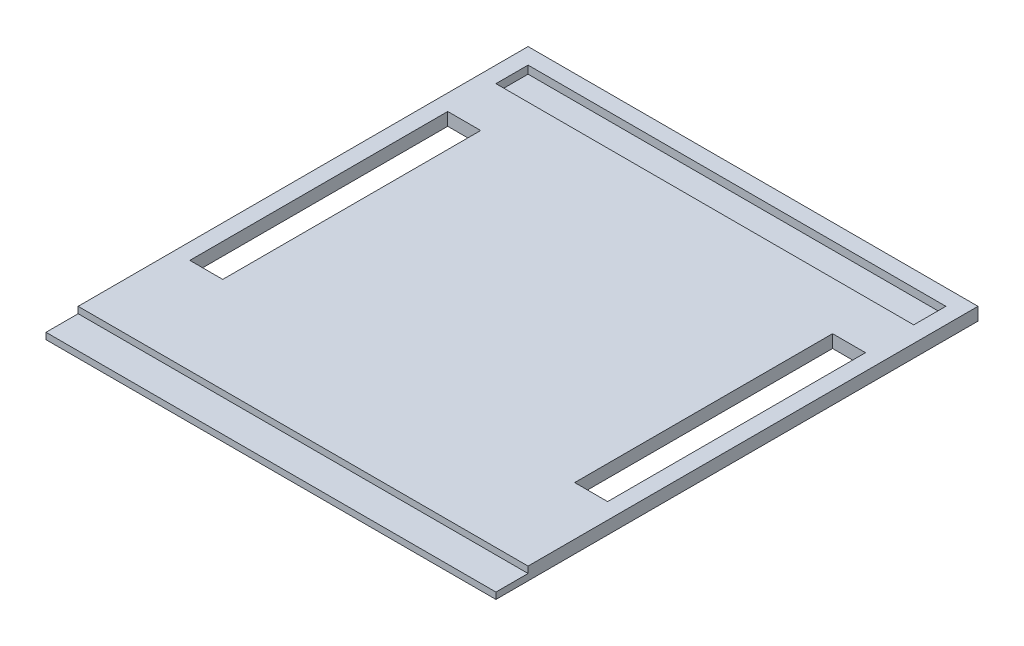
ISO-10303-21;
HEADER;
FILE_DESCRIPTION(('STEP AP214'),'2;1');
FILE_NAME('part.step','',(''),(''),'','','');
FILE_SCHEMA(('AUTOMOTIVE_DESIGN { 1 0 10303 214 1 1 1 1 }'));
ENDSEC;
DATA;
#1=APPLICATION_CONTEXT('core data for automotive mechanical design processes');
#2=APPLICATION_PROTOCOL_DEFINITION('international standard','automotive_design',2000,#1);
#3=PRODUCT_CONTEXT('',#1,'mechanical');
#4=PRODUCT('Part','Part','',(#3));
#5=PRODUCT_RELATED_PRODUCT_CATEGORY('part','',(#4));
#6=PRODUCT_DEFINITION_FORMATION('','',#4);
#7=PRODUCT_DEFINITION_CONTEXT('part definition',#1,'design');
#8=PRODUCT_DEFINITION('design','',#6,#7);
#9=PRODUCT_DEFINITION_SHAPE('','',#8);
#10=(LENGTH_UNIT() NAMED_UNIT(*) SI_UNIT(.MILLI.,.METRE.));
#11=(NAMED_UNIT(*) PLANE_ANGLE_UNIT() SI_UNIT($,.RADIAN.));
#12=(NAMED_UNIT(*) SI_UNIT($,.STERADIAN.) SOLID_ANGLE_UNIT());
#13=UNCERTAINTY_MEASURE_WITH_UNIT(LENGTH_MEASURE(1.E-05),#10,'distance_accuracy_value','');
#14=(GEOMETRIC_REPRESENTATION_CONTEXT(3) GLOBAL_UNCERTAINTY_ASSIGNED_CONTEXT((#13)) GLOBAL_UNIT_ASSIGNED_CONTEXT((#10,
#11,#12)) REPRESENTATION_CONTEXT('',''));
#15=CARTESIAN_POINT('',(0.,0.,0.));
#16=DIRECTION('',(0.,0.,1.));
#17=DIRECTION('',(1.,0.,0.));
#18=AXIS2_PLACEMENT_3D('',#15,#16,#17);
#19=CARTESIAN_POINT('',(0.,29.,-70.));
#20=DIRECTION('',(0.,0.,-1.));
#21=DIRECTION('',(-1.,0.,0.));
#22=AXIS2_PLACEMENT_3D('',#19,#20,#21);
#23=PLANE('',#22);
#24=DIRECTION('',(-1.,0.,0.));
#25=VECTOR('',#24,1.);
#26=CARTESIAN_POINT('',(0.,2.,-70.));
#27=LINE('',#26,#25);
#28=CARTESIAN_POINT('',(70.,2.00000000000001,-70.));
#29=VERTEX_POINT('',#28);
#30=CARTESIAN_POINT('',(-70.,2.,-70.));
#31=VERTEX_POINT('',#30);
#32=EDGE_CURVE('E64',#29,#31,#27,.T.);
#33=ORIENTED_EDGE('',*,*,#32,.F.);
#34=DIRECTION('',(0.,-1.,0.));
#35=VECTOR('',#34,1.);
#36=CARTESIAN_POINT('',(70.,29.,-70.));
#37=LINE('',#36,#35);
#38=CARTESIAN_POINT('',(70.,4.00000000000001,-70.));
#39=VERTEX_POINT('',#38);
#40=EDGE_CURVE('E220',#39,#29,#37,.T.);
#41=ORIENTED_EDGE('',*,*,#40,.F.);
#42=DIRECTION('',(-1.,0.,0.));
#43=VECTOR('',#42,1.);
#44=CARTESIAN_POINT('',(0.,4.,-70.));
#45=LINE('',#44,#43);
#46=CARTESIAN_POINT('',(-70.,4.00000000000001,-70.));
#47=VERTEX_POINT('',#46);
#48=EDGE_CURVE('E235',#39,#47,#45,.T.);
#49=ORIENTED_EDGE('',*,*,#48,.T.);
#50=DIRECTION('',(0.,-1.,0.));
#51=VECTOR('',#50,1.);
#52=CARTESIAN_POINT('',(-70.,29.,-70.));
#53=LINE('',#52,#51);
#54=EDGE_CURVE('E231',#47,#31,#53,.T.);
#55=ORIENTED_EDGE('',*,*,#54,.T.);
#56=EDGE_LOOP('',(#33,#41,#49,#55));
#57=FACE_BOUND('',#56,.T.);
#58=ADVANCED_FACE('F45',(#57),#23,.F.);
#59=CARTESIAN_POINT('',(0.,4.,0.));
#60=DIRECTION('',(0.,1.,0.));
#61=DIRECTION('',(0.,0.,1.));
#62=AXIS2_PLACEMENT_3D('',#59,#60,#61);
#63=PLANE('',#62);
#64=ORIENTED_EDGE('',*,*,#48,.F.);
#65=DIRECTION('',(0.,0.,-1.));
#66=VECTOR('',#65,1.);
#67=CARTESIAN_POINT('',(70.,4.,-210.));
#68=LINE('',#67,#66);
#69=CARTESIAN_POINT('',(70.,4.,-210.));
#70=VERTEX_POINT('',#69);
#71=EDGE_CURVE('E337',#39,#70,#68,.T.);
#72=ORIENTED_EDGE('',*,*,#71,.T.);
#73=DIRECTION('',(-1.,0.,0.));
#74=VECTOR('',#73,1.);
#75=CARTESIAN_POINT('',(-70.,4.,-210.));
#76=LINE('',#75,#74);
#77=CARTESIAN_POINT('',(-70.,4.,-210.));
#78=VERTEX_POINT('',#77);
#79=EDGE_CURVE('E340',#70,#78,#76,.T.);
#80=ORIENTED_EDGE('',*,*,#79,.T.);
#81=DIRECTION('',(0.,0.,1.));
#82=VECTOR('',#81,1.);
#83=CARTESIAN_POINT('',(-70.,4.,-210.));
#84=LINE('',#83,#82);
#85=EDGE_CURVE('E344',#78,#47,#84,.T.);
#86=ORIENTED_EDGE('',*,*,#85,.T.);
#87=EDGE_LOOP('',(#64,#72,#80,#86));
#88=FACE_BOUND('',#87,.T.);
#89=DIRECTION('',(0.,0.,1.));
#90=VECTOR('',#89,1.);
#91=CARTESIAN_POINT('',(-65.,4.,-205.));
#92=LINE('',#91,#90);
#93=CARTESIAN_POINT('',(-65.,4.,-205.));
#94=VERTEX_POINT('',#93);
#95=CARTESIAN_POINT('',(-65.,4.,-195.));
#96=VERTEX_POINT('',#95);
#97=EDGE_CURVE('E75',#94,#96,#92,.T.);
#98=ORIENTED_EDGE('',*,*,#97,.F.);
#99=DIRECTION('',(1.,0.,0.));
#100=VECTOR('',#99,1.);
#101=CARTESIAN_POINT('',(-65.,4.,-205.));
#102=LINE('',#101,#100);
#103=CARTESIAN_POINT('',(65.,4.,-205.));
#104=VERTEX_POINT('',#103);
#105=EDGE_CURVE('E245',#94,#104,#102,.T.);
#106=ORIENTED_EDGE('',*,*,#105,.T.);
#107=DIRECTION('',(0.,0.,1.));
#108=VECTOR('',#107,1.);
#109=CARTESIAN_POINT('',(65.,4.,-205.));
#110=LINE('',#109,#108);
#111=CARTESIAN_POINT('',(65.,4.,-195.));
#112=VERTEX_POINT('',#111);
#113=EDGE_CURVE('E262',#104,#112,#110,.T.);
#114=ORIENTED_EDGE('',*,*,#113,.T.);
#115=DIRECTION('',(1.,0.,0.));
#116=VECTOR('',#115,1.);
#117=CARTESIAN_POINT('',(-65.,4.,-195.));
#118=LINE('',#117,#116);
#119=EDGE_CURVE('E258',#96,#112,#118,.T.);
#120=ORIENTED_EDGE('',*,*,#119,.F.);
#121=EDGE_LOOP('',(#98,#106,#114,#120));
#122=FACE_BOUND('',#121,.T.);
#123=DIRECTION('',(0.,0.,1.));
#124=VECTOR('',#123,1.);
#125=CARTESIAN_POINT('',(-65.,4.,-180.));
#126=LINE('',#125,#124);
#127=CARTESIAN_POINT('',(-65.,4.,-180.));
#128=VERTEX_POINT('',#127);
#129=CARTESIAN_POINT('',(-65.,4.,-99.75));
#130=VERTEX_POINT('',#129);
#131=EDGE_CURVE('E281',#128,#130,#126,.T.);
#132=ORIENTED_EDGE('',*,*,#131,.F.);
#133=DIRECTION('',(-1.,0.,0.));
#134=VECTOR('',#133,1.);
#135=CARTESIAN_POINT('',(-65.,4.,-180.));
#136=LINE('',#135,#134);
#137=CARTESIAN_POINT('',(-54.75,4.,-180.));
#138=VERTEX_POINT('',#137);
#139=EDGE_CURVE('E293',#138,#128,#136,.T.);
#140=ORIENTED_EDGE('',*,*,#139,.F.);
#141=DIRECTION('',(0.,0.,-1.));
#142=VECTOR('',#141,1.);
#143=CARTESIAN_POINT('',(-54.75,4.,-180.));
#144=LINE('',#143,#142);
#145=CARTESIAN_POINT('',(-54.75,4.,-99.75));
#146=VERTEX_POINT('',#145);
#147=EDGE_CURVE('E289',#146,#138,#144,.T.);
#148=ORIENTED_EDGE('',*,*,#147,.F.);
#149=DIRECTION('',(1.,0.,0.));
#150=VECTOR('',#149,1.);
#151=CARTESIAN_POINT('',(-65.,4.,-99.75));
#152=LINE('',#151,#150);
#153=EDGE_CURVE('E284',#130,#146,#152,.T.);
#154=ORIENTED_EDGE('',*,*,#153,.F.);
#155=EDGE_LOOP('',(#132,#140,#148,#154));
#156=FACE_BOUND('',#155,.T.);
#157=DIRECTION('',(0.,0.,1.));
#158=VECTOR('',#157,1.);
#159=CARTESIAN_POINT('',(54.75,4.,-180.));
#160=LINE('',#159,#158);
#161=CARTESIAN_POINT('',(54.75,4.,-180.));
#162=VERTEX_POINT('',#161);
#163=CARTESIAN_POINT('',(54.75,4.,-99.75));
#164=VERTEX_POINT('',#163);
#165=EDGE_CURVE('E272',#162,#164,#160,.T.);
#166=ORIENTED_EDGE('',*,*,#165,.F.);
#167=DIRECTION('',(-1.,0.,0.));
#168=VECTOR('',#167,1.);
#169=CARTESIAN_POINT('',(54.75,4.,-180.));
#170=LINE('',#169,#168);
#171=CARTESIAN_POINT('',(65.,4.,-180.));
#172=VERTEX_POINT('',#171);
#173=EDGE_CURVE('E321',#172,#162,#170,.T.);
#174=ORIENTED_EDGE('',*,*,#173,.F.);
#175=DIRECTION('',(0.,0.,-1.));
#176=VECTOR('',#175,1.);
#177=CARTESIAN_POINT('',(65.,4.,-180.));
#178=LINE('',#177,#176);
#179=CARTESIAN_POINT('',(65.,4.,-99.75));
#180=VERTEX_POINT('',#179);
#181=EDGE_CURVE('E317',#180,#172,#178,.T.);
#182=ORIENTED_EDGE('',*,*,#181,.F.);
#183=DIRECTION('',(1.,0.,0.));
#184=VECTOR('',#183,1.);
#185=CARTESIAN_POINT('',(54.75,4.,-99.75));
#186=LINE('',#185,#184);
#187=EDGE_CURVE('E313',#164,#180,#186,.T.);
#188=ORIENTED_EDGE('',*,*,#187,.F.);
#189=EDGE_LOOP('',(#166,#174,#182,#188));
#190=FACE_BOUND('',#189,.T.);
#191=ADVANCED_FACE('F403',(#88,#122,#156,#190),#63,.T.);
#192=CARTESIAN_POINT('',(70.,4.,-210.));
#193=DIRECTION('',(-1.,0.,0.));
#194=DIRECTION('',(0.,0.,1.));
#195=AXIS2_PLACEMENT_3D('',#192,#193,#194);
#196=PLANE('',#195);
#197=ORIENTED_EDGE('',*,*,#71,.F.);
#198=ORIENTED_EDGE('',*,*,#40,.T.);
#199=DIRECTION('',(0.,0.,1.));
#200=VECTOR('',#199,1.);
#201=CARTESIAN_POINT('',(70.,2.,0.));
#202=LINE('',#201,#200);
#203=CARTESIAN_POINT('',(70.,2.,-60.));
#204=VERTEX_POINT('',#203);
#205=EDGE_CURVE('E201',#29,#204,#202,.T.);
#206=ORIENTED_EDGE('',*,*,#205,.T.);
#207=DIRECTION('',(0.,-1.,0.));
#208=VECTOR('',#207,1.);
#209=CARTESIAN_POINT('',(70.,2.,-60.));
#210=LINE('',#209,#208);
#211=CARTESIAN_POINT('',(70.,0.,-60.));
#212=VERTEX_POINT('',#211);
#213=EDGE_CURVE('E211',#204,#212,#210,.T.);
#214=ORIENTED_EDGE('',*,*,#213,.T.);
#215=DIRECTION('',(0.,0.,-1.));
#216=VECTOR('',#215,1.);
#217=CARTESIAN_POINT('',(70.,0.,-210.));
#218=LINE('',#217,#216);
#219=CARTESIAN_POINT('',(70.,0.,-210.));
#220=VERTEX_POINT('',#219);
#221=EDGE_CURVE('E301',#212,#220,#218,.T.);
#222=ORIENTED_EDGE('',*,*,#221,.T.);
#223=DIRECTION('',(0.,-1.,0.));
#224=VECTOR('',#223,1.);
#225=CARTESIAN_POINT('',(70.,4.,-210.));
#226=LINE('',#225,#224);
#227=EDGE_CURVE('E359',#70,#220,#226,.T.);
#228=ORIENTED_EDGE('',*,*,#227,.F.);
#229=EDGE_LOOP('',(#197,#198,#206,#214,#222,#228));
#230=FACE_BOUND('',#229,.T.);
#231=ADVANCED_FACE('F47',(#230),#196,.F.);
#232=CARTESIAN_POINT('',(-70.,4.,-210.));
#233=DIRECTION('',(0.,0.,1.));
#234=DIRECTION('',(1.,0.,0.));
#235=AXIS2_PLACEMENT_3D('',#232,#233,#234);
#236=PLANE('',#235);
#237=DIRECTION('',(-1.,0.,0.));
#238=VECTOR('',#237,1.);
#239=CARTESIAN_POINT('',(-70.,0.,-210.));
#240=LINE('',#239,#238);
#241=CARTESIAN_POINT('',(-70.,0.,-210.));
#242=VERTEX_POINT('',#241);
#243=EDGE_CURVE('E351',#220,#242,#240,.T.);
#244=ORIENTED_EDGE('',*,*,#243,.T.);
#245=DIRECTION('',(0.,-1.,0.));
#246=VECTOR('',#245,1.);
#247=CARTESIAN_POINT('',(-70.,4.,-210.));
#248=LINE('',#247,#246);
#249=EDGE_CURVE('E348',#78,#242,#248,.T.);
#250=ORIENTED_EDGE('',*,*,#249,.F.);
#251=ORIENTED_EDGE('',*,*,#79,.F.);
#252=ORIENTED_EDGE('',*,*,#227,.T.);
#253=EDGE_LOOP('',(#244,#250,#251,#252));
#254=FACE_BOUND('',#253,.T.);
#255=ADVANCED_FACE('F473',(#254),#236,.F.);
#256=CARTESIAN_POINT('',(-70.,4.,-210.));
#257=DIRECTION('',(1.,0.,0.));
#258=DIRECTION('',(0.,0.,-1.));
#259=AXIS2_PLACEMENT_3D('',#256,#257,#258);
#260=PLANE('',#259);
#261=DIRECTION('',(0.,0.,1.));
#262=VECTOR('',#261,1.);
#263=CARTESIAN_POINT('',(-70.,0.,-210.));
#264=LINE('',#263,#262);
#265=CARTESIAN_POINT('',(-70.,0.,-60.));
#266=VERTEX_POINT('',#265);
#267=EDGE_CURVE('E341',#242,#266,#264,.T.);
#268=ORIENTED_EDGE('',*,*,#267,.T.);
#269=DIRECTION('',(0.,-1.,0.));
#270=VECTOR('',#269,1.);
#271=CARTESIAN_POINT('',(-70.,2.,-60.));
#272=LINE('',#271,#270);
#273=CARTESIAN_POINT('',(-70.,2.,-60.));
#274=VERTEX_POINT('',#273);
#275=EDGE_CURVE('E217',#274,#266,#272,.T.);
#276=ORIENTED_EDGE('',*,*,#275,.F.);
#277=DIRECTION('',(0.,0.,1.));
#278=VECTOR('',#277,1.);
#279=CARTESIAN_POINT('',(-70.,2.,0.));
#280=LINE('',#279,#278);
#281=EDGE_CURVE('E203',#31,#274,#280,.T.);
#282=ORIENTED_EDGE('',*,*,#281,.F.);
#283=ORIENTED_EDGE('',*,*,#54,.F.);
#284=ORIENTED_EDGE('',*,*,#85,.F.);
#285=ORIENTED_EDGE('',*,*,#249,.T.);
#286=EDGE_LOOP('',(#268,#276,#282,#283,#284,#285));
#287=FACE_BOUND('',#286,.T.);
#288=ADVANCED_FACE('F471',(#287),#260,.F.);
#289=CARTESIAN_POINT('',(0.,0.,0.));
#290=DIRECTION('',(0.,1.,0.));
#291=DIRECTION('',(0.,0.,1.));
#292=AXIS2_PLACEMENT_3D('',#289,#290,#291);
#293=PLANE('',#292);
#294=DIRECTION('',(-1.,0.,0.));
#295=VECTOR('',#294,1.);
#296=CARTESIAN_POINT('',(0.,0.,-180.));
#297=LINE('',#296,#295);
#298=CARTESIAN_POINT('',(-54.75,0.,-180.));
#299=VERTEX_POINT('',#298);
#300=CARTESIAN_POINT('',(-65.,0.,-180.));
#301=VERTEX_POINT('',#300);
#302=EDGE_CURVE('E54',#299,#301,#297,.T.);
#303=ORIENTED_EDGE('',*,*,#302,.T.);
#304=DIRECTION('',(0.,0.,1.));
#305=VECTOR('',#304,1.);
#306=CARTESIAN_POINT('',(-65.,0.,0.));
#307=LINE('',#306,#305);
#308=CARTESIAN_POINT('',(-65.,0.,-99.75));
#309=VERTEX_POINT('',#308);
#310=EDGE_CURVE('E11',#301,#309,#307,.T.);
#311=ORIENTED_EDGE('',*,*,#310,.T.);
#312=DIRECTION('',(1.,0.,0.));
#313=VECTOR('',#312,1.);
#314=CARTESIAN_POINT('',(1.35054569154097E-13,0.,-99.7499999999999));
#315=LINE('',#314,#313);
#316=CARTESIAN_POINT('',(-54.75,0.,-99.75));
#317=VERTEX_POINT('',#316);
#318=EDGE_CURVE('E379',#309,#317,#315,.T.);
#319=ORIENTED_EDGE('',*,*,#318,.T.);
#320=DIRECTION('',(0.,0.,-1.));
#321=VECTOR('',#320,1.);
#322=CARTESIAN_POINT('',(-54.75,0.,0.));
#323=LINE('',#322,#321);
#324=EDGE_CURVE('E383',#317,#299,#323,.T.);
#325=ORIENTED_EDGE('',*,*,#324,.T.);
#326=EDGE_LOOP('',(#303,#311,#319,#325));
#327=FACE_BOUND('',#326,.T.);
#328=DIRECTION('',(-1.,0.,0.));
#329=VECTOR('',#328,1.);
#330=CARTESIAN_POINT('',(0.,0.,-180.));
#331=LINE('',#330,#329);
#332=CARTESIAN_POINT('',(65.,0.,-180.));
#333=VERTEX_POINT('',#332);
#334=CARTESIAN_POINT('',(54.75,0.,-180.));
#335=VERTEX_POINT('',#334);
#336=EDGE_CURVE('E371',#333,#335,#331,.T.);
#337=ORIENTED_EDGE('',*,*,#336,.T.);
#338=DIRECTION('',(0.,0.,1.));
#339=VECTOR('',#338,1.);
#340=CARTESIAN_POINT('',(54.75,0.,0.));
#341=LINE('',#340,#339);
#342=CARTESIAN_POINT('',(54.75,0.,-99.75));
#343=VERTEX_POINT('',#342);
#344=EDGE_CURVE('E375',#335,#343,#341,.T.);
#345=ORIENTED_EDGE('',*,*,#344,.T.);
#346=DIRECTION('',(1.,0.,0.));
#347=VECTOR('',#346,1.);
#348=CARTESIAN_POINT('',(1.35054569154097E-13,0.,-99.7500000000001));
#349=LINE('',#348,#347);
#350=CARTESIAN_POINT('',(65.,0.,-99.75));
#351=VERTEX_POINT('',#350);
#352=EDGE_CURVE('E363',#343,#351,#349,.T.);
#353=ORIENTED_EDGE('',*,*,#352,.T.);
#354=DIRECTION('',(0.,0.,-1.));
#355=VECTOR('',#354,1.);
#356=CARTESIAN_POINT('',(65.,0.,0.));
#357=LINE('',#356,#355);
#358=EDGE_CURVE('E367',#351,#333,#357,.T.);
#359=ORIENTED_EDGE('',*,*,#358,.T.);
#360=EDGE_LOOP('',(#337,#345,#353,#359));
#361=FACE_BOUND('',#360,.T.);
#362=ORIENTED_EDGE('',*,*,#221,.F.);
#363=DIRECTION('',(1.,0.,0.));
#364=VECTOR('',#363,1.);
#365=CARTESIAN_POINT('',(0.,0.,-60.));
#366=LINE('',#365,#364);
#367=EDGE_CURVE('E214',#266,#212,#366,.T.);
#368=ORIENTED_EDGE('',*,*,#367,.F.);
#369=ORIENTED_EDGE('',*,*,#267,.F.);
#370=ORIENTED_EDGE('',*,*,#243,.F.);
#371=EDGE_LOOP('',(#362,#368,#369,#370));
#372=FACE_BOUND('',#371,.T.);
#373=ADVANCED_FACE('F389',(#327,#361,#372),#293,.F.);
#374=CARTESIAN_POINT('',(54.75,-21.4,-180.));
#375=DIRECTION('',(-1.,0.,0.));
#376=DIRECTION('',(0.,0.,1.));
#377=AXIS2_PLACEMENT_3D('',#374,#375,#376);
#378=PLANE('',#377);
#379=DIRECTION('',(0.,1.,0.));
#380=VECTOR('',#379,1.);
#381=CARTESIAN_POINT('',(54.75,-21.4,-180.));
#382=LINE('',#381,#380);
#383=EDGE_CURVE('E285',#335,#162,#382,.T.);
#384=ORIENTED_EDGE('',*,*,#383,.T.);
#385=ORIENTED_EDGE('',*,*,#165,.T.);
#386=DIRECTION('',(0.,1.,0.));
#387=VECTOR('',#386,1.);
#388=CARTESIAN_POINT('',(54.75,-21.4,-99.75));
#389=LINE('',#388,#387);
#390=EDGE_CURVE('E325',#343,#164,#389,.T.);
#391=ORIENTED_EDGE('',*,*,#390,.F.);
#392=ORIENTED_EDGE('',*,*,#344,.F.);
#393=EDGE_LOOP('',(#384,#385,#391,#392));
#394=FACE_BOUND('',#393,.T.);
#395=ADVANCED_FACE('F461',(#394),#378,.F.);
#396=CARTESIAN_POINT('',(54.75,-21.4,-180.));
#397=DIRECTION('',(0.,0.,-1.));
#398=DIRECTION('',(-1.,0.,0.));
#399=AXIS2_PLACEMENT_3D('',#396,#397,#398);
#400=PLANE('',#399);
#401=DIRECTION('',(0.,1.,0.));
#402=VECTOR('',#401,1.);
#403=CARTESIAN_POINT('',(65.,-21.4,-180.));
#404=LINE('',#403,#402);
#405=EDGE_CURVE('E328',#333,#172,#404,.T.);
#406=ORIENTED_EDGE('',*,*,#405,.T.);
#407=ORIENTED_EDGE('',*,*,#173,.T.);
#408=ORIENTED_EDGE('',*,*,#383,.F.);
#409=ORIENTED_EDGE('',*,*,#336,.F.);
#410=EDGE_LOOP('',(#406,#407,#408,#409));
#411=FACE_BOUND('',#410,.T.);
#412=ADVANCED_FACE('F458',(#411),#400,.F.);
#413=CARTESIAN_POINT('',(65.,-21.4,-180.));
#414=DIRECTION('',(1.,0.,0.));
#415=DIRECTION('',(0.,0.,-1.));
#416=AXIS2_PLACEMENT_3D('',#413,#414,#415);
#417=PLANE('',#416);
#418=DIRECTION('',(0.,1.,0.));
#419=VECTOR('',#418,1.);
#420=CARTESIAN_POINT('',(65.,-21.4,-99.75));
#421=LINE('',#420,#419);
#422=EDGE_CURVE('E331',#351,#180,#421,.T.);
#423=ORIENTED_EDGE('',*,*,#422,.T.);
#424=ORIENTED_EDGE('',*,*,#181,.T.);
#425=ORIENTED_EDGE('',*,*,#405,.F.);
#426=ORIENTED_EDGE('',*,*,#358,.F.);
#427=EDGE_LOOP('',(#423,#424,#425,#426));
#428=FACE_BOUND('',#427,.T.);
#429=ADVANCED_FACE('F454',(#428),#417,.F.);
#430=CARTESIAN_POINT('',(54.75,-21.4,-99.75));
#431=DIRECTION('',(0.,0.,1.));
#432=DIRECTION('',(1.,0.,0.));
#433=AXIS2_PLACEMENT_3D('',#430,#431,#432);
#434=PLANE('',#433);
#435=ORIENTED_EDGE('',*,*,#390,.T.);
#436=ORIENTED_EDGE('',*,*,#187,.T.);
#437=ORIENTED_EDGE('',*,*,#422,.F.);
#438=ORIENTED_EDGE('',*,*,#352,.F.);
#439=EDGE_LOOP('',(#435,#436,#437,#438));
#440=FACE_BOUND('',#439,.T.);
#441=ADVANCED_FACE('F450',(#440),#434,.F.);
#442=CARTESIAN_POINT('',(-65.,-21.4,-180.));
#443=DIRECTION('',(-1.,0.,0.));
#444=DIRECTION('',(0.,0.,1.));
#445=AXIS2_PLACEMENT_3D('',#442,#443,#444);
#446=PLANE('',#445);
#447=DIRECTION('',(0.,1.,0.));
#448=VECTOR('',#447,1.);
#449=CARTESIAN_POINT('',(-65.,-21.4,-180.));
#450=LINE('',#449,#448);
#451=EDGE_CURVE('E298',#301,#128,#450,.T.);
#452=ORIENTED_EDGE('',*,*,#451,.T.);
#453=ORIENTED_EDGE('',*,*,#131,.T.);
#454=DIRECTION('',(0.,1.,0.));
#455=VECTOR('',#454,1.);
#456=CARTESIAN_POINT('',(-65.,-21.4,-99.75));
#457=LINE('',#456,#455);
#458=EDGE_CURVE('E297',#309,#130,#457,.T.);
#459=ORIENTED_EDGE('',*,*,#458,.F.);
#460=ORIENTED_EDGE('',*,*,#310,.F.);
#461=EDGE_LOOP('',(#452,#453,#459,#460));
#462=FACE_BOUND('',#461,.T.);
#463=ADVANCED_FACE('F407',(#462),#446,.F.);
#464=CARTESIAN_POINT('',(-65.,-21.4,-180.));
#465=DIRECTION('',(0.,0.,-1.));
#466=DIRECTION('',(-1.,0.,0.));
#467=AXIS2_PLACEMENT_3D('',#464,#465,#466);
#468=PLANE('',#467);
#469=DIRECTION('',(0.,1.,0.));
#470=VECTOR('',#469,1.);
#471=CARTESIAN_POINT('',(-54.75,-21.4,-180.));
#472=LINE('',#471,#470);
#473=EDGE_CURVE('E302',#299,#138,#472,.T.);
#474=ORIENTED_EDGE('',*,*,#473,.T.);
#475=ORIENTED_EDGE('',*,*,#139,.T.);
#476=ORIENTED_EDGE('',*,*,#451,.F.);
#477=ORIENTED_EDGE('',*,*,#302,.F.);
#478=EDGE_LOOP('',(#474,#475,#476,#477));
#479=FACE_BOUND('',#478,.T.);
#480=ADVANCED_FACE('F395',(#479),#468,.F.);
#481=CARTESIAN_POINT('',(-54.75,-21.4,-180.));
#482=DIRECTION('',(1.,0.,0.));
#483=DIRECTION('',(0.,0.,-1.));
#484=AXIS2_PLACEMENT_3D('',#481,#482,#483);
#485=PLANE('',#484);
#486=DIRECTION('',(0.,1.,0.));
#487=VECTOR('',#486,1.);
#488=CARTESIAN_POINT('',(-54.75,-21.4,-99.75));
#489=LINE('',#488,#487);
#490=EDGE_CURVE('E305',#317,#146,#489,.T.);
#491=ORIENTED_EDGE('',*,*,#490,.T.);
#492=ORIENTED_EDGE('',*,*,#147,.T.);
#493=ORIENTED_EDGE('',*,*,#473,.F.);
#494=ORIENTED_EDGE('',*,*,#324,.F.);
#495=EDGE_LOOP('',(#491,#492,#493,#494));
#496=FACE_BOUND('',#495,.T.);
#497=ADVANCED_FACE('F397',(#496),#485,.F.);
#498=CARTESIAN_POINT('',(-65.,-21.4,-99.75));
#499=DIRECTION('',(0.,0.,1.));
#500=DIRECTION('',(1.,0.,0.));
#501=AXIS2_PLACEMENT_3D('',#498,#499,#500);
#502=PLANE('',#501);
#503=ORIENTED_EDGE('',*,*,#458,.T.);
#504=ORIENTED_EDGE('',*,*,#153,.T.);
#505=ORIENTED_EDGE('',*,*,#490,.F.);
#506=ORIENTED_EDGE('',*,*,#318,.F.);
#507=EDGE_LOOP('',(#503,#504,#505,#506));
#508=FACE_BOUND('',#507,.T.);
#509=ADVANCED_FACE('F409',(#508),#502,.F.);
#510=CARTESIAN_POINT('',(-65.,1.55,-205.));
#511=DIRECTION('',(-1.,0.,0.));
#512=DIRECTION('',(0.,0.,1.));
#513=AXIS2_PLACEMENT_3D('',#510,#511,#512);
#514=PLANE('',#513);
#515=ORIENTED_EDGE('',*,*,#97,.T.);
#516=DIRECTION('',(0.,1.,0.));
#517=VECTOR('',#516,1.);
#518=CARTESIAN_POINT('',(-65.,1.55,-195.));
#519=LINE('',#518,#517);
#520=CARTESIAN_POINT('',(-65.,1.55,-195.));
#521=VERTEX_POINT('',#520);
#522=EDGE_CURVE('E255',#521,#96,#519,.T.);
#523=ORIENTED_EDGE('',*,*,#522,.F.);
#524=DIRECTION('',(0.,0.,1.));
#525=VECTOR('',#524,1.);
#526=CARTESIAN_POINT('',(-65.,1.55,-205.));
#527=LINE('',#526,#525);
#528=CARTESIAN_POINT('',(-65.,1.55,-205.));
#529=VERTEX_POINT('',#528);
#530=EDGE_CURVE('E240',#529,#521,#527,.T.);
#531=ORIENTED_EDGE('',*,*,#530,.F.);
#532=DIRECTION('',(0.,1.,0.));
#533=VECTOR('',#532,1.);
#534=CARTESIAN_POINT('',(-65.,1.55,-205.));
#535=LINE('',#534,#533);
#536=EDGE_CURVE('E269',#529,#94,#535,.T.);
#537=ORIENTED_EDGE('',*,*,#536,.T.);
#538=EDGE_LOOP('',(#515,#523,#531,#537));
#539=FACE_BOUND('',#538,.T.);
#540=ADVANCED_FACE('F411',(#539),#514,.F.);
#541=CARTESIAN_POINT('',(-65.,1.55,-205.));
#542=DIRECTION('',(0.,0.,1.));
#543=DIRECTION('',(1.,0.,0.));
#544=AXIS2_PLACEMENT_3D('',#541,#542,#543);
#545=PLANE('',#544);
#546=ORIENTED_EDGE('',*,*,#105,.F.);
#547=ORIENTED_EDGE('',*,*,#536,.F.);
#548=DIRECTION('',(1.,0.,0.));
#549=VECTOR('',#548,1.);
#550=CARTESIAN_POINT('',(-65.,1.55,-205.));
#551=LINE('',#550,#549);
#552=CARTESIAN_POINT('',(65.,1.55,-205.));
#553=VERTEX_POINT('',#552);
#554=EDGE_CURVE('E252',#529,#553,#551,.T.);
#555=ORIENTED_EDGE('',*,*,#554,.T.);
#556=DIRECTION('',(0.,1.,0.));
#557=VECTOR('',#556,1.);
#558=CARTESIAN_POINT('',(65.,1.55,-205.));
#559=LINE('',#558,#557);
#560=EDGE_CURVE('E273',#553,#104,#559,.T.);
#561=ORIENTED_EDGE('',*,*,#560,.T.);
#562=EDGE_LOOP('',(#546,#547,#555,#561));
#563=FACE_BOUND('',#562,.T.);
#564=ADVANCED_FACE('F417',(#563),#545,.T.);
#565=CARTESIAN_POINT('',(65.,1.55,-205.));
#566=DIRECTION('',(-1.,0.,0.));
#567=DIRECTION('',(0.,0.,1.));
#568=AXIS2_PLACEMENT_3D('',#565,#566,#567);
#569=PLANE('',#568);
#570=ORIENTED_EDGE('',*,*,#113,.F.);
#571=ORIENTED_EDGE('',*,*,#560,.F.);
#572=DIRECTION('',(0.,0.,1.));
#573=VECTOR('',#572,1.);
#574=CARTESIAN_POINT('',(65.,1.55,-205.));
#575=LINE('',#574,#573);
#576=CARTESIAN_POINT('',(65.,1.55,-195.));
#577=VERTEX_POINT('',#576);
#578=EDGE_CURVE('E249',#553,#577,#575,.T.);
#579=ORIENTED_EDGE('',*,*,#578,.T.);
#580=DIRECTION('',(0.,1.,0.));
#581=VECTOR('',#580,1.);
#582=CARTESIAN_POINT('',(65.,1.55,-195.));
#583=LINE('',#582,#581);
#584=EDGE_CURVE('E276',#577,#112,#583,.T.);
#585=ORIENTED_EDGE('',*,*,#584,.T.);
#586=EDGE_LOOP('',(#570,#571,#579,#585));
#587=FACE_BOUND('',#586,.T.);
#588=ADVANCED_FACE('F438',(#587),#569,.T.);
#589=CARTESIAN_POINT('',(-65.,1.55,-195.));
#590=DIRECTION('',(0.,0.,1.));
#591=DIRECTION('',(1.,0.,0.));
#592=AXIS2_PLACEMENT_3D('',#589,#590,#591);
#593=PLANE('',#592);
#594=ORIENTED_EDGE('',*,*,#119,.T.);
#595=ORIENTED_EDGE('',*,*,#584,.F.);
#596=DIRECTION('',(1.,0.,0.));
#597=VECTOR('',#596,1.);
#598=CARTESIAN_POINT('',(-65.,1.55,-195.));
#599=LINE('',#598,#597);
#600=EDGE_CURVE('E244',#521,#577,#599,.T.);
#601=ORIENTED_EDGE('',*,*,#600,.F.);
#602=ORIENTED_EDGE('',*,*,#522,.T.);
#603=EDGE_LOOP('',(#594,#595,#601,#602));
#604=FACE_BOUND('',#603,.T.);
#605=ADVANCED_FACE('F434',(#604),#593,.F.);
#606=CARTESIAN_POINT('',(0.,1.55,0.));
#607=DIRECTION('',(0.,1.,0.));
#608=DIRECTION('',(0.,0.,1.));
#609=AXIS2_PLACEMENT_3D('',#606,#607,#608);
#610=PLANE('',#609);
#611=ORIENTED_EDGE('',*,*,#530,.T.);
#612=ORIENTED_EDGE('',*,*,#600,.T.);
#613=ORIENTED_EDGE('',*,*,#578,.F.);
#614=ORIENTED_EDGE('',*,*,#554,.F.);
#615=EDGE_LOOP('',(#611,#612,#613,#614));
#616=FACE_BOUND('',#615,.T.);
#617=ADVANCED_FACE('F431',(#616),#610,.T.);
#618=CARTESIAN_POINT('',(0.,2.,-60.));
#619=DIRECTION('',(0.,0.,-1.));
#620=DIRECTION('',(-1.,0.,0.));
#621=AXIS2_PLACEMENT_3D('',#618,#619,#620);
#622=PLANE('',#621);
#623=ORIENTED_EDGE('',*,*,#367,.T.);
#624=ORIENTED_EDGE('',*,*,#213,.F.);
#625=DIRECTION('',(1.,0.,0.));
#626=VECTOR('',#625,1.);
#627=CARTESIAN_POINT('',(0.,2.,-60.));
#628=LINE('',#627,#626);
#629=EDGE_CURVE('E197',#274,#204,#628,.T.);
#630=ORIENTED_EDGE('',*,*,#629,.F.);
#631=ORIENTED_EDGE('',*,*,#275,.T.);
#632=EDGE_LOOP('',(#623,#624,#630,#631));
#633=FACE_BOUND('',#632,.T.);
#634=ADVANCED_FACE('F212',(#633),#622,.F.);
#635=CARTESIAN_POINT('',(0.,2.,0.));
#636=DIRECTION('',(0.,-1.,0.));
#637=DIRECTION('',(0.,0.,-1.));
#638=AXIS2_PLACEMENT_3D('',#635,#636,#637);
#639=PLANE('',#638);
#640=ORIENTED_EDGE('',*,*,#32,.T.);
#641=ORIENTED_EDGE('',*,*,#281,.T.);
#642=ORIENTED_EDGE('',*,*,#629,.T.);
#643=ORIENTED_EDGE('',*,*,#205,.F.);
#644=EDGE_LOOP('',(#640,#641,#642,#643));
#645=FACE_BOUND('',#644,.T.);
#646=ADVANCED_FACE('F199',(#645),#639,.F.);
#647=CLOSED_SHELL('',(#58,#191,#231,#255,#288,#373,#395,#412,#429,#441,#463,#480,#497,#509,#540,
#564,#588,#605,#617,#634,#646));
#648=MANIFOLD_SOLID_BREP('B2',#647);
#649=ADVANCED_BREP_SHAPE_REPRESENTATION('',(#18,#648),#14);
#650=SHAPE_DEFINITION_REPRESENTATION(#9,#649);
ENDSEC;
END-ISO-10303-21;
